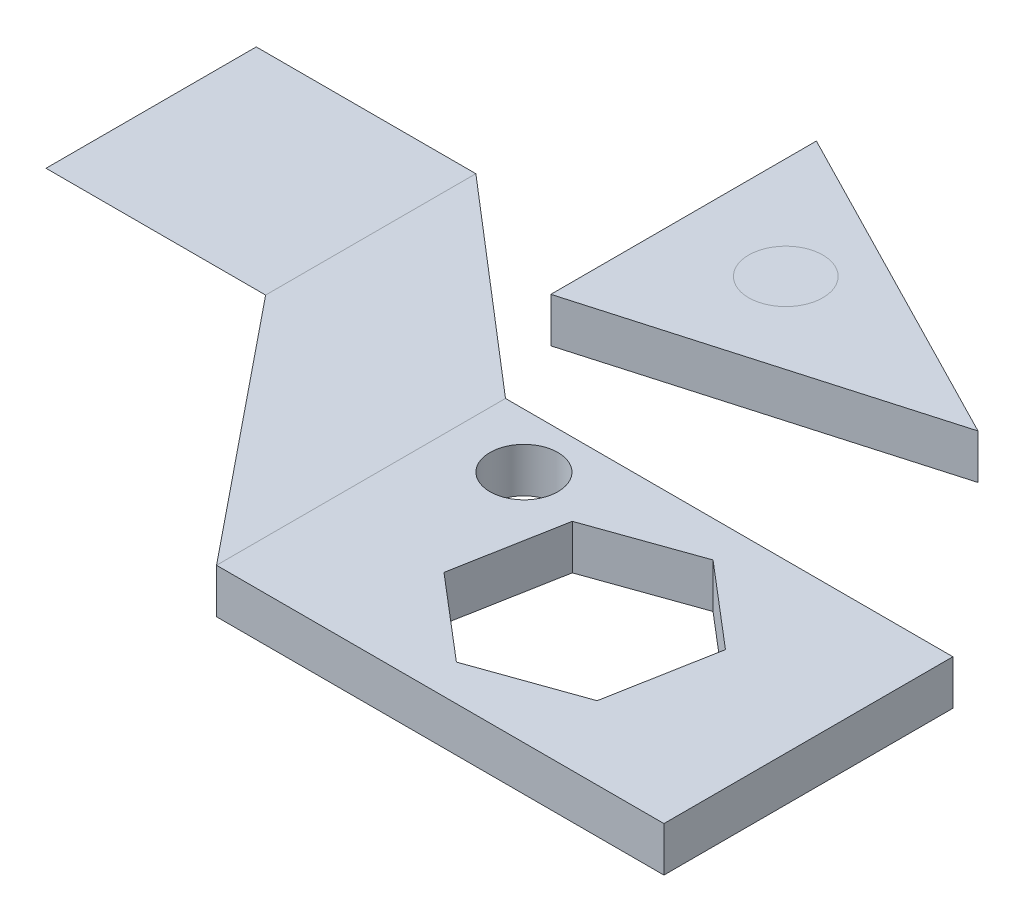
ISO-10303-21;
HEADER;
FILE_DESCRIPTION(('STEP AP214'),'2;1');
FILE_NAME('part.step','',(''),(''),'','','');
FILE_SCHEMA(('AUTOMOTIVE_DESIGN { 1 0 10303 214 1 1 1 1 }'));
ENDSEC;
DATA;
#1=APPLICATION_CONTEXT('core data for automotive mechanical design processes');
#2=APPLICATION_PROTOCOL_DEFINITION('international standard','automotive_design',2000,#1);
#3=PRODUCT_CONTEXT('',#1,'mechanical');
#4=PRODUCT('Part','Part','',(#3));
#5=PRODUCT_RELATED_PRODUCT_CATEGORY('part','',(#4));
#6=PRODUCT_DEFINITION_FORMATION('','',#4);
#7=PRODUCT_DEFINITION_CONTEXT('part definition',#1,'design');
#8=PRODUCT_DEFINITION('design','',#6,#7);
#9=PRODUCT_DEFINITION_SHAPE('','',#8);
#10=(LENGTH_UNIT() NAMED_UNIT(*) SI_UNIT(.MILLI.,.METRE.));
#11=(NAMED_UNIT(*) PLANE_ANGLE_UNIT() SI_UNIT($,.RADIAN.));
#12=(NAMED_UNIT(*) SI_UNIT($,.STERADIAN.) SOLID_ANGLE_UNIT());
#13=UNCERTAINTY_MEASURE_WITH_UNIT(LENGTH_MEASURE(1.E-05),#10,'distance_accuracy_value','');
#14=(GEOMETRIC_REPRESENTATION_CONTEXT(3) GLOBAL_UNCERTAINTY_ASSIGNED_CONTEXT((#13)) GLOBAL_UNIT_ASSIGNED_CONTEXT((#10,
#11,#12)) REPRESENTATION_CONTEXT('',''));
#15=CARTESIAN_POINT('',(0.,0.,0.));
#16=DIRECTION('',(0.,0.,1.));
#17=DIRECTION('',(1.,0.,0.));
#18=AXIS2_PLACEMENT_3D('',#15,#16,#17);
#19=CARTESIAN_POINT('',(-80.7820942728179,0.,81.5293352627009));
#20=DIRECTION('',(0.,-1.,0.));
#21=DIRECTION('',(0.,0.,-1.));
#22=AXIS2_PLACEMENT_3D('',#19,#20,#21);
#23=PLANE('',#22);
#24=DIRECTION('',(0.,0.,-1.));
#25=VECTOR('',#24,1.);
#26=CARTESIAN_POINT('',(-80.7820942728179,0.,21.7119363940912));
#27=LINE('',#26,#25);
#28=CARTESIAN_POINT('',(-80.7820942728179,0.,81.5293352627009));
#29=VERTEX_POINT('',#28);
#30=CARTESIAN_POINT('',(-80.7820942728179,0.,-38.1054624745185));
#31=VERTEX_POINT('',#30);
#32=EDGE_CURVE('E13',#29,#31,#27,.T.);
#33=ORIENTED_EDGE('',*,*,#32,.T.);
#34=DIRECTION('',(0.758711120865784,0.,0.651427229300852));
#35=VECTOR('',#34,1.);
#36=CARTESIAN_POINT('',(-21.1909433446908,0.,13.0593317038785));
#37=LINE('',#36,#35);
#38=CARTESIAN_POINT('',(38.4002075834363,0.,64.2241258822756));
#39=VERTEX_POINT('',#38);
#40=EDGE_CURVE('E71',#31,#39,#37,.T.);
#41=ORIENTED_EDGE('',*,*,#40,.T.);
#42=DIRECTION('',(0.,0.,1.));
#43=VECTOR('',#42,1.);
#44=CARTESIAN_POINT('',(38.4002075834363,0.,146.432685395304));
#45=LINE('',#44,#43);
#46=CARTESIAN_POINT('',(38.4002075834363,0.,228.641244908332));
#47=VERTEX_POINT('',#46);
#48=EDGE_CURVE('E79',#39,#47,#45,.T.);
#49=ORIENTED_EDGE('',*,*,#48,.T.);
#50=DIRECTION('',(-0.629490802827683,0.,-0.777007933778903));
#51=VECTOR('',#50,1.);
#52=CARTESIAN_POINT('',(-21.1909433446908,0.,155.085290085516));
#53=LINE('',#52,#51);
#54=EDGE_CURVE('E65',#47,#29,#53,.T.);
#55=ORIENTED_EDGE('',*,*,#54,.T.);
#56=EDGE_LOOP('',(#33,#41,#49,#55));
#57=FACE_BOUND('',#56,.T.);
#58=ADVANCED_FACE('F64',(#57),#23,.T.);
#59=OPEN_SHELL('',(#58));
#60=SHELL_BASED_SURFACE_MODEL('B2',(#59));
#61=CARTESIAN_POINT('',(0.,0.,0.));
#62=DIRECTION('',(0.,1.,0.));
#63=DIRECTION('',(0.,0.,1.));
#64=AXIS2_PLACEMENT_3D('',#61,#62,#63);
#65=PLANE('',#64);
#66=CARTESIAN_POINT('',(79.9464688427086,0.,95.2665323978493));
#67=DIRECTION('',(0.,1.,0.));
#68=DIRECTION('',(0.,0.,1.));
#69=AXIS2_PLACEMENT_3D('',#66,#67,#68);
#70=CIRCLE('',#69,19.3434847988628);
#71=CARTESIAN_POINT('',(79.9464688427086,0.,114.610017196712));
#72=VERTEX_POINT('',#71);
#73=EDGE_CURVE('E162',#72,#72,#70,.T.);
#74=ORIENTED_EDGE('',*,*,#73,.F.);
#75=EDGE_LOOP('',(#74));
#76=FACE_BOUND('',#75,.T.);
#77=DIRECTION('',(0.761243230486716,0.,0.648466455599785));
#78=VECTOR('',#77,1.);
#79=CARTESIAN_POINT('',(106.609295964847,0.,167.440394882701));
#80=LINE('',#79,#78);
#81=CARTESIAN_POINT('',(106.609295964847,0.,167.440394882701));
#82=VERTEX_POINT('',#81);
#83=CARTESIAN_POINT('',(154.343298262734,0.,208.102693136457));
#84=VERTEX_POINT('',#83);
#85=EDGE_CURVE('E155',#82,#84,#80,.T.);
#86=ORIENTED_EDGE('',*,*,#85,.F.);
#87=DIRECTION('',(-0.180966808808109,0.,0.983489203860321));
#88=VECTOR('',#87,1.);
#89=CARTESIAN_POINT('',(117.956878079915,0.,105.770387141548));
#90=LINE('',#89,#88);
#91=CARTESIAN_POINT('',(117.956878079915,0.,105.770387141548));
#92=VERTEX_POINT('',#91);
#93=EDGE_CURVE('E157',#92,#82,#90,.T.);
#94=ORIENTED_EDGE('',*,*,#93,.F.);
#95=DIRECTION('',(-0.942210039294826,0.,0.335022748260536));
#96=VECTOR('',#95,1.);
#97=CARTESIAN_POINT('',(177.03846249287,0.,84.7626776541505));
#98=LINE('',#97,#96);
#99=CARTESIAN_POINT('',(177.03846249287,0.,84.7626776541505));
#100=VERTEX_POINT('',#99);
#101=EDGE_CURVE('E165',#100,#92,#98,.T.);
#102=ORIENTED_EDGE('',*,*,#101,.F.);
#103=DIRECTION('',(-0.761243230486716,0.,-0.648466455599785));
#104=VECTOR('',#103,1.);
#105=CARTESIAN_POINT('',(224.772464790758,0.,125.424975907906));
#106=LINE('',#105,#104);
#107=CARTESIAN_POINT('',(224.772464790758,0.,125.424975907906));
#108=VERTEX_POINT('',#107);
#109=EDGE_CURVE('E170',#108,#100,#106,.T.);
#110=ORIENTED_EDGE('',*,*,#109,.F.);
#111=DIRECTION('',(0.180966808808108,0.,-0.983489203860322));
#112=VECTOR('',#111,1.);
#113=CARTESIAN_POINT('',(213.42488267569,0.,187.094983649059));
#114=LINE('',#113,#112);
#115=CARTESIAN_POINT('',(213.42488267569,0.,187.094983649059));
#116=VERTEX_POINT('',#115);
#117=EDGE_CURVE('E177',#116,#108,#114,.T.);
#118=ORIENTED_EDGE('',*,*,#117,.F.);
#119=DIRECTION('',(0.942210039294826,0.,-0.335022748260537));
#120=VECTOR('',#119,1.);
#121=CARTESIAN_POINT('',(154.343298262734,0.,208.102693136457));
#122=LINE('',#121,#120);
#123=EDGE_CURVE('E160',#84,#116,#122,.T.);
#124=ORIENTED_EDGE('',*,*,#123,.F.);
#125=EDGE_LOOP('',(#86,#94,#102,#110,#118,#124));
#126=FACE_BOUND('',#125,.T.);
#127=DIRECTION('',(0.,0.,1.));
#128=VECTOR('',#127,1.);
#129=CARTESIAN_POINT('',(38.4002075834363,0.,64.2241258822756));
#130=LINE('',#129,#128);
#131=CARTESIAN_POINT('',(38.4002075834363,0.,64.2241258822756));
#132=VERTEX_POINT('',#131);
#133=CARTESIAN_POINT('',(38.4002075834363,0.,228.641244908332));
#134=VERTEX_POINT('',#133);
#135=EDGE_CURVE('E125',#132,#134,#130,.T.);
#136=ORIENTED_EDGE('',*,*,#135,.T.);
#137=DIRECTION('',(1.,0.,0.));
#138=VECTOR('',#137,1.);
#139=CARTESIAN_POINT('',(38.4002075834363,0.,228.641244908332));
#140=LINE('',#139,#138);
#141=CARTESIAN_POINT('',(292.981553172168,0.,228.641244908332));
#142=VERTEX_POINT('',#141);
#143=EDGE_CURVE('E185',#134,#142,#140,.T.);
#144=ORIENTED_EDGE('',*,*,#143,.T.);
#145=DIRECTION('',(0.,0.,-1.));
#146=VECTOR('',#145,1.);
#147=CARTESIAN_POINT('',(292.981553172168,0.,64.2241258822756));
#148=LINE('',#147,#146);
#149=CARTESIAN_POINT('',(292.981553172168,0.,64.2241258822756));
#150=VERTEX_POINT('',#149);
#151=EDGE_CURVE('E121',#142,#150,#148,.T.);
#152=ORIENTED_EDGE('',*,*,#151,.T.);
#153=DIRECTION('',(-1.,0.,0.));
#154=VECTOR('',#153,1.);
#155=CARTESIAN_POINT('',(38.4002075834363,0.,64.2241258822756));
#156=LINE('',#155,#154);
#157=EDGE_CURVE('E62',#150,#132,#156,.T.);
#158=ORIENTED_EDGE('',*,*,#157,.T.);
#159=EDGE_LOOP('',(#136,#144,#152,#158));
#160=FACE_BOUND('',#159,.T.);
#161=ADVANCED_FACE('F116',(#76,#126,#160),#65,.T.);
#162=OPEN_SHELL('',(#161));
#163=SHELL_BASED_SURFACE_MODEL('B7',(#162));
#164=CARTESIAN_POINT('',(58.0016480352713,0.,-75.6757600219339));
#165=DIRECTION('',(0.,1.,0.));
#166=DIRECTION('',(0.,0.,1.));
#167=AXIS2_PLACEMENT_3D('',#164,#165,#166);
#168=PLANE('',#167);
#169=CARTESIAN_POINT('',(58.0016480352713,0.,-75.6757600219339));
#170=DIRECTION('',(0.,1.,0.));
#171=DIRECTION('',(0.,0.,1.));
#172=AXIS2_PLACEMENT_3D('',#169,#170,#171);
#173=CIRCLE('',#172,21.0766431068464);
#174=CARTESIAN_POINT('',(58.0016480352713,0.,-54.5991169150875));
#175=VERTEX_POINT('',#174);
#176=EDGE_CURVE('E115',#175,#175,#173,.T.);
#177=ORIENTED_EDGE('',*,*,#176,.T.);
#178=EDGE_LOOP('',(#177));
#179=FACE_BOUND('',#178,.T.);
#180=ADVANCED_FACE('F233',(#179),#168,.T.);
#181=OPEN_SHELL('',(#180));
#182=SHELL_BASED_SURFACE_MODEL('B56',(#181));
#183=CARTESIAN_POINT('',(0.,0.,0.));
#184=DIRECTION('',(0.,1.,0.));
#185=DIRECTION('',(0.,0.,1.));
#186=AXIS2_PLACEMENT_3D('',#183,#184,#185);
#187=PLANE('',#186);
#188=DIRECTION('',(0.,0.,1.));
#189=VECTOR('',#188,1.);
#190=CARTESIAN_POINT('',(-205.750421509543,0.,-38.1054624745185));
#191=LINE('',#190,#189);
#192=CARTESIAN_POINT('',(-205.750421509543,0.,-38.1054624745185));
#193=VERTEX_POINT('',#192);
#194=CARTESIAN_POINT('',(-205.750421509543,0.,81.5293352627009));
#195=VERTEX_POINT('',#194);
#196=EDGE_CURVE('E269',#193,#195,#191,.T.);
#197=ORIENTED_EDGE('',*,*,#196,.T.);
#198=DIRECTION('',(1.,0.,0.));
#199=VECTOR('',#198,1.);
#200=CARTESIAN_POINT('',(-205.750421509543,0.,81.5293352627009));
#201=LINE('',#200,#199);
#202=CARTESIAN_POINT('',(-80.7820942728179,0.,81.5293352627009));
#203=VERTEX_POINT('',#202);
#204=EDGE_CURVE('E280',#195,#203,#201,.T.);
#205=ORIENTED_EDGE('',*,*,#204,.T.);
#206=DIRECTION('',(0.,0.,-1.));
#207=VECTOR('',#206,1.);
#208=CARTESIAN_POINT('',(-80.7820942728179,0.,-38.1054624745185));
#209=LINE('',#208,#207);
#210=CARTESIAN_POINT('',(-80.7820942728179,0.,-38.1054624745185));
#211=VERTEX_POINT('',#210);
#212=EDGE_CURVE('E265',#203,#211,#209,.T.);
#213=ORIENTED_EDGE('',*,*,#212,.T.);
#214=DIRECTION('',(-1.,0.,0.));
#215=VECTOR('',#214,1.);
#216=CARTESIAN_POINT('',(-205.750421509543,0.,-38.1054624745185));
#217=LINE('',#216,#215);
#218=EDGE_CURVE('E231',#211,#193,#217,.T.);
#219=ORIENTED_EDGE('',*,*,#218,.T.);
#220=EDGE_LOOP('',(#197,#205,#213,#219));
#221=FACE_BOUND('',#220,.T.);
#222=ADVANCED_FACE('F260',(#221),#187,.T.);
#223=OPEN_SHELL('',(#222));
#224=SHELL_BASED_SURFACE_MODEL('B110',(#223));
#225=CARTESIAN_POINT('',(38.4002075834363,-25.4,64.2241258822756));
#226=DIRECTION('',(-1.,0.,0.));
#227=DIRECTION('',(0.,0.,1.));
#228=AXIS2_PLACEMENT_3D('',#225,#226,#227);
#229=PLANE('',#228);
#230=DIRECTION('',(0.,0.,1.));
#231=VECTOR('',#230,1.);
#232=CARTESIAN_POINT('',(38.4002075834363,0.,64.2241258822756));
#233=LINE('',#232,#231);
#234=CARTESIAN_POINT('',(38.4002075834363,0.,64.2241258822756));
#235=VERTEX_POINT('',#234);
#236=CARTESIAN_POINT('',(38.4002075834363,0.,228.641244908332));
#237=VERTEX_POINT('',#236);
#238=EDGE_CURVE('E440',#235,#237,#233,.T.);
#239=ORIENTED_EDGE('',*,*,#238,.F.);
#240=DIRECTION('',(0.,1.,0.));
#241=VECTOR('',#240,1.);
#242=CARTESIAN_POINT('',(38.4002075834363,-25.4,64.2241258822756));
#243=LINE('',#242,#241);
#244=CARTESIAN_POINT('',(38.4002075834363,-25.4,64.2241258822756));
#245=VERTEX_POINT('',#244);
#246=EDGE_CURVE('E258',#245,#235,#243,.T.);
#247=ORIENTED_EDGE('',*,*,#246,.F.);
#248=DIRECTION('',(0.,0.,1.));
#249=VECTOR('',#248,1.);
#250=CARTESIAN_POINT('',(38.4002075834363,-25.4,64.2241258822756));
#251=LINE('',#250,#249);
#252=CARTESIAN_POINT('',(38.4002075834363,-25.4,228.641244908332));
#253=VERTEX_POINT('',#252);
#254=EDGE_CURVE('E451',#245,#253,#251,.T.);
#255=ORIENTED_EDGE('',*,*,#254,.T.);
#256=DIRECTION('',(0.,1.,0.));
#257=VECTOR('',#256,1.);
#258=CARTESIAN_POINT('',(38.4002075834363,-25.4,228.641244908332));
#259=LINE('',#258,#257);
#260=EDGE_CURVE('E314',#253,#237,#259,.T.);
#261=ORIENTED_EDGE('',*,*,#260,.T.);
#262=EDGE_LOOP('',(#239,#247,#255,#261));
#263=FACE_BOUND('',#262,.T.);
#264=ADVANCED_FACE('F312',(#263),#229,.T.);
#265=CARTESIAN_POINT('',(38.4002075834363,-25.4,64.2241258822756));
#266=DIRECTION('',(0.,0.,-1.));
#267=DIRECTION('',(-1.,0.,0.));
#268=AXIS2_PLACEMENT_3D('',#265,#266,#267);
#269=PLANE('',#268);
#270=DIRECTION('',(-1.,0.,0.));
#271=VECTOR('',#270,1.);
#272=CARTESIAN_POINT('',(38.4002075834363,0.,64.2241258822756));
#273=LINE('',#272,#271);
#274=CARTESIAN_POINT('',(292.981553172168,0.,64.2241258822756));
#275=VERTEX_POINT('',#274);
#276=EDGE_CURVE('E455',#275,#235,#273,.T.);
#277=ORIENTED_EDGE('',*,*,#276,.F.);
#278=DIRECTION('',(0.,1.,0.));
#279=VECTOR('',#278,1.);
#280=CARTESIAN_POINT('',(292.981553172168,-25.4,64.2241258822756));
#281=LINE('',#280,#279);
#282=CARTESIAN_POINT('',(292.981553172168,-25.4,64.2241258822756));
#283=VERTEX_POINT('',#282);
#284=EDGE_CURVE('E318',#283,#275,#281,.T.);
#285=ORIENTED_EDGE('',*,*,#284,.F.);
#286=DIRECTION('',(-1.,0.,0.));
#287=VECTOR('',#286,1.);
#288=CARTESIAN_POINT('',(38.4002075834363,-25.4,64.2241258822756));
#289=LINE('',#288,#287);
#290=EDGE_CURVE('E461',#283,#245,#289,.T.);
#291=ORIENTED_EDGE('',*,*,#290,.T.);
#292=ORIENTED_EDGE('',*,*,#246,.T.);
#293=EDGE_LOOP('',(#277,#285,#291,#292));
#294=FACE_BOUND('',#293,.T.);
#295=ADVANCED_FACE('F492',(#294),#269,.T.);
#296=CARTESIAN_POINT('',(292.981553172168,-25.4,64.2241258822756));
#297=DIRECTION('',(1.,0.,0.));
#298=DIRECTION('',(0.,0.,-1.));
#299=AXIS2_PLACEMENT_3D('',#296,#297,#298);
#300=PLANE('',#299);
#301=DIRECTION('',(0.,0.,-1.));
#302=VECTOR('',#301,1.);
#303=CARTESIAN_POINT('',(292.981553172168,0.,64.2241258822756));
#304=LINE('',#303,#302);
#305=CARTESIAN_POINT('',(292.981553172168,0.,228.641244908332));
#306=VERTEX_POINT('',#305);
#307=EDGE_CURVE('E471',#306,#275,#304,.T.);
#308=ORIENTED_EDGE('',*,*,#307,.F.);
#309=DIRECTION('',(0.,1.,0.));
#310=VECTOR('',#309,1.);
#311=CARTESIAN_POINT('',(292.981553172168,-25.4,228.641244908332));
#312=LINE('',#311,#310);
#313=CARTESIAN_POINT('',(292.981553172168,-25.4,228.641244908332));
#314=VERTEX_POINT('',#313);
#315=EDGE_CURVE('E478',#314,#306,#312,.T.);
#316=ORIENTED_EDGE('',*,*,#315,.F.);
#317=DIRECTION('',(0.,0.,-1.));
#318=VECTOR('',#317,1.);
#319=CARTESIAN_POINT('',(292.981553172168,-25.4,64.2241258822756));
#320=LINE('',#319,#318);
#321=EDGE_CURVE('E458',#314,#283,#320,.T.);
#322=ORIENTED_EDGE('',*,*,#321,.T.);
#323=ORIENTED_EDGE('',*,*,#284,.T.);
#324=EDGE_LOOP('',(#308,#316,#322,#323));
#325=FACE_BOUND('',#324,.T.);
#326=ADVANCED_FACE('F490',(#325),#300,.T.);
#327=CARTESIAN_POINT('',(38.4002075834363,-25.4,228.641244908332));
#328=DIRECTION('',(0.,0.,1.));
#329=DIRECTION('',(1.,0.,0.));
#330=AXIS2_PLACEMENT_3D('',#327,#328,#329);
#331=PLANE('',#330);
#332=DIRECTION('',(1.,0.,0.));
#333=VECTOR('',#332,1.);
#334=CARTESIAN_POINT('',(38.4002075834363,0.,228.641244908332));
#335=LINE('',#334,#333);
#336=EDGE_CURVE('E467',#237,#306,#335,.T.);
#337=ORIENTED_EDGE('',*,*,#336,.F.);
#338=ORIENTED_EDGE('',*,*,#260,.F.);
#339=DIRECTION('',(1.,0.,0.));
#340=VECTOR('',#339,1.);
#341=CARTESIAN_POINT('',(38.4002075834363,-25.4,228.641244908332));
#342=LINE('',#341,#340);
#343=EDGE_CURVE('E454',#253,#314,#342,.T.);
#344=ORIENTED_EDGE('',*,*,#343,.T.);
#345=ORIENTED_EDGE('',*,*,#315,.T.);
#346=EDGE_LOOP('',(#337,#338,#344,#345));
#347=FACE_BOUND('',#346,.T.);
#348=ADVANCED_FACE('F486',(#347),#331,.T.);
#349=CARTESIAN_POINT('',(0.,-25.4,0.));
#350=DIRECTION('',(0.,1.,0.));
#351=DIRECTION('',(0.,0.,1.));
#352=AXIS2_PLACEMENT_3D('',#349,#350,#351);
#353=PLANE('',#352);
#354=CARTESIAN_POINT('',(79.9464688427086,-25.4,95.2665323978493));
#355=DIRECTION('',(0.,1.,0.));
#356=DIRECTION('',(0.,0.,1.));
#357=AXIS2_PLACEMENT_3D('',#354,#355,#356);
#358=CIRCLE('',#357,19.3434847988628);
#359=CARTESIAN_POINT('',(79.9464688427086,-25.4,114.610017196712));
#360=VERTEX_POINT('',#359);
#361=EDGE_CURVE('E427',#360,#360,#358,.T.);
#362=ORIENTED_EDGE('',*,*,#361,.T.);
#363=EDGE_LOOP('',(#362));
#364=FACE_BOUND('',#363,.T.);
#365=DIRECTION('',(0.761243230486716,0.,0.648466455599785));
#366=VECTOR('',#365,1.);
#367=CARTESIAN_POINT('',(106.609295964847,-25.4,167.440394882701));
#368=LINE('',#367,#366);
#369=CARTESIAN_POINT('',(106.609295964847,-25.4,167.440394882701));
#370=VERTEX_POINT('',#369);
#371=CARTESIAN_POINT('',(154.343298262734,-25.4,208.102693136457));
#372=VERTEX_POINT('',#371);
#373=EDGE_CURVE('E398',#370,#372,#368,.T.);
#374=ORIENTED_EDGE('',*,*,#373,.T.);
#375=DIRECTION('',(0.942210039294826,0.,-0.335022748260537));
#376=VECTOR('',#375,1.);
#377=CARTESIAN_POINT('',(154.343298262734,-25.4,208.102693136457));
#378=LINE('',#377,#376);
#379=CARTESIAN_POINT('',(213.42488267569,-25.4,187.094983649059));
#380=VERTEX_POINT('',#379);
#381=EDGE_CURVE('E392',#372,#380,#378,.T.);
#382=ORIENTED_EDGE('',*,*,#381,.T.);
#383=DIRECTION('',(0.180966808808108,0.,-0.983489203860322));
#384=VECTOR('',#383,1.);
#385=CARTESIAN_POINT('',(213.42488267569,-25.4,187.094983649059));
#386=LINE('',#385,#384);
#387=CARTESIAN_POINT('',(224.772464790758,-25.4,125.424975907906));
#388=VERTEX_POINT('',#387);
#389=EDGE_CURVE('E401',#380,#388,#386,.T.);
#390=ORIENTED_EDGE('',*,*,#389,.T.);
#391=DIRECTION('',(-0.761243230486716,0.,-0.648466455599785));
#392=VECTOR('',#391,1.);
#393=CARTESIAN_POINT('',(224.772464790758,-25.4,125.424975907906));
#394=LINE('',#393,#392);
#395=CARTESIAN_POINT('',(177.03846249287,-25.4,84.7626776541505));
#396=VERTEX_POINT('',#395);
#397=EDGE_CURVE('E326',#388,#396,#394,.T.);
#398=ORIENTED_EDGE('',*,*,#397,.T.);
#399=DIRECTION('',(-0.942210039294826,0.,0.335022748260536));
#400=VECTOR('',#399,1.);
#401=CARTESIAN_POINT('',(177.03846249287,-25.4,84.7626776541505));
#402=LINE('',#401,#400);
#403=CARTESIAN_POINT('',(117.956878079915,-25.4,105.770387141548));
#404=VERTEX_POINT('',#403);
#405=EDGE_CURVE('E419',#396,#404,#402,.T.);
#406=ORIENTED_EDGE('',*,*,#405,.T.);
#407=DIRECTION('',(-0.180966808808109,0.,0.983489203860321));
#408=VECTOR('',#407,1.);
#409=CARTESIAN_POINT('',(117.956878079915,-25.4,105.770387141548));
#410=LINE('',#409,#408);
#411=EDGE_CURVE('E422',#404,#370,#410,.T.);
#412=ORIENTED_EDGE('',*,*,#411,.T.);
#413=EDGE_LOOP('',(#374,#382,#390,#398,#406,#412));
#414=FACE_BOUND('',#413,.T.);
#415=ORIENTED_EDGE('',*,*,#254,.F.);
#416=ORIENTED_EDGE('',*,*,#290,.F.);
#417=ORIENTED_EDGE('',*,*,#321,.F.);
#418=ORIENTED_EDGE('',*,*,#343,.F.);
#419=EDGE_LOOP('',(#415,#416,#417,#418));
#420=FACE_BOUND('',#419,.T.);
#421=ADVANCED_FACE('F405',(#364,#414,#420),#353,.F.);
#422=CARTESIAN_POINT('',(154.343298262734,-25.4,208.102693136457));
#423=DIRECTION('',(0.335022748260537,0.,0.942210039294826));
#424=DIRECTION('',(0.942210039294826,0.,-0.335022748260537));
#425=AXIS2_PLACEMENT_3D('',#422,#423,#424);
#426=PLANE('',#425);
#427=DIRECTION('',(0.942210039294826,0.,-0.335022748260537));
#428=VECTOR('',#427,1.);
#429=CARTESIAN_POINT('',(154.343298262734,0.,208.102693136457));
#430=LINE('',#429,#428);
#431=CARTESIAN_POINT('',(154.343298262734,0.,208.102693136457));
#432=VERTEX_POINT('',#431);
#433=CARTESIAN_POINT('',(213.42488267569,0.,187.094983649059));
#434=VERTEX_POINT('',#433);
#435=EDGE_CURVE('E395',#432,#434,#430,.T.);
#436=ORIENTED_EDGE('',*,*,#435,.T.);
#437=DIRECTION('',(0.,1.,0.));
#438=VECTOR('',#437,1.);
#439=CARTESIAN_POINT('',(213.42488267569,-25.4,187.094983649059));
#440=LINE('',#439,#438);
#441=EDGE_CURVE('E387',#380,#434,#440,.T.);
#442=ORIENTED_EDGE('',*,*,#441,.F.);
#443=ORIENTED_EDGE('',*,*,#381,.F.);
#444=DIRECTION('',(0.,1.,0.));
#445=VECTOR('',#444,1.);
#446=CARTESIAN_POINT('',(154.343298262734,-25.4,208.102693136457));
#447=LINE('',#446,#445);
#448=EDGE_CURVE('E438',#372,#432,#447,.T.);
#449=ORIENTED_EDGE('',*,*,#448,.T.);
#450=EDGE_LOOP('',(#436,#442,#443,#449));
#451=FACE_BOUND('',#450,.T.);
#452=ADVANCED_FACE('F389',(#451),#426,.F.);
#453=CARTESIAN_POINT('',(106.609295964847,-25.4,167.440394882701));
#454=DIRECTION('',(-0.648466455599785,0.,0.761243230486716));
#455=DIRECTION('',(0.761243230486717,0.,0.648466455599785));
#456=AXIS2_PLACEMENT_3D('',#453,#454,#455);
#457=PLANE('',#456);
#458=DIRECTION('',(0.761243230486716,0.,0.648466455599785));
#459=VECTOR('',#458,1.);
#460=CARTESIAN_POINT('',(106.609295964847,0.,167.440394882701));
#461=LINE('',#460,#459);
#462=CARTESIAN_POINT('',(106.609295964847,0.,167.440394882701));
#463=VERTEX_POINT('',#462);
#464=EDGE_CURVE('E409',#463,#432,#461,.T.);
#465=ORIENTED_EDGE('',*,*,#464,.T.);
#466=ORIENTED_EDGE('',*,*,#448,.F.);
#467=ORIENTED_EDGE('',*,*,#373,.F.);
#468=DIRECTION('',(0.,1.,0.));
#469=VECTOR('',#468,1.);
#470=CARTESIAN_POINT('',(106.609295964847,-25.4,167.440394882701));
#471=LINE('',#470,#469);
#472=EDGE_CURVE('E441',#370,#463,#471,.T.);
#473=ORIENTED_EDGE('',*,*,#472,.T.);
#474=EDGE_LOOP('',(#465,#466,#467,#473));
#475=FACE_BOUND('',#474,.T.);
#476=ADVANCED_FACE('F510',(#475),#457,.F.);
#477=CARTESIAN_POINT('',(117.956878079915,-25.4,105.770387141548));
#478=DIRECTION('',(-0.983489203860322,0.,-0.180966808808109));
#479=DIRECTION('',(-0.180966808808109,0.,0.983489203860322));
#480=AXIS2_PLACEMENT_3D('',#477,#478,#479);
#481=PLANE('',#480);
#482=DIRECTION('',(-0.180966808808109,0.,0.983489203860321));
#483=VECTOR('',#482,1.);
#484=CARTESIAN_POINT('',(117.956878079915,0.,105.770387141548));
#485=LINE('',#484,#483);
#486=CARTESIAN_POINT('',(117.956878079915,0.,105.770387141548));
#487=VERTEX_POINT('',#486);
#488=EDGE_CURVE('E412',#487,#463,#485,.T.);
#489=ORIENTED_EDGE('',*,*,#488,.T.);
#490=ORIENTED_EDGE('',*,*,#472,.F.);
#491=ORIENTED_EDGE('',*,*,#411,.F.);
#492=DIRECTION('',(0.,1.,0.));
#493=VECTOR('',#492,1.);
#494=CARTESIAN_POINT('',(117.956878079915,-25.4,105.770387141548));
#495=LINE('',#494,#493);
#496=EDGE_CURVE('E444',#404,#487,#495,.T.);
#497=ORIENTED_EDGE('',*,*,#496,.T.);
#498=EDGE_LOOP('',(#489,#490,#491,#497));
#499=FACE_BOUND('',#498,.T.);
#500=ADVANCED_FACE('F531',(#499),#481,.F.);
#501=CARTESIAN_POINT('',(177.03846249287,-25.4,84.7626776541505));
#502=DIRECTION('',(-0.335022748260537,0.,-0.942210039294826));
#503=DIRECTION('',(-0.942210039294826,0.,0.335022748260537));
#504=AXIS2_PLACEMENT_3D('',#501,#502,#503);
#505=PLANE('',#504);
#506=DIRECTION('',(-0.942210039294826,0.,0.335022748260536));
#507=VECTOR('',#506,1.);
#508=CARTESIAN_POINT('',(177.03846249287,0.,84.7626776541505));
#509=LINE('',#508,#507);
#510=CARTESIAN_POINT('',(177.03846249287,0.,84.7626776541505));
#511=VERTEX_POINT('',#510);
#512=EDGE_CURVE('E433',#511,#487,#509,.T.);
#513=ORIENTED_EDGE('',*,*,#512,.T.);
#514=ORIENTED_EDGE('',*,*,#496,.F.);
#515=ORIENTED_EDGE('',*,*,#405,.F.);
#516=DIRECTION('',(0.,1.,0.));
#517=VECTOR('',#516,1.);
#518=CARTESIAN_POINT('',(177.03846249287,-25.4,84.7626776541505));
#519=LINE('',#518,#517);
#520=EDGE_CURVE('E447',#396,#511,#519,.T.);
#521=ORIENTED_EDGE('',*,*,#520,.T.);
#522=EDGE_LOOP('',(#513,#514,#515,#521));
#523=FACE_BOUND('',#522,.T.);
#524=ADVANCED_FACE('F535',(#523),#505,.F.);
#525=CARTESIAN_POINT('',(224.772464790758,-25.4,125.424975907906));
#526=DIRECTION('',(0.648466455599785,0.,-0.761243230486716));
#527=DIRECTION('',(-0.761243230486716,0.,-0.648466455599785));
#528=AXIS2_PLACEMENT_3D('',#525,#526,#527);
#529=PLANE('',#528);
#530=DIRECTION('',(-0.761243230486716,0.,-0.648466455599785));
#531=VECTOR('',#530,1.);
#532=CARTESIAN_POINT('',(224.772464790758,0.,125.424975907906));
#533=LINE('',#532,#531);
#534=CARTESIAN_POINT('',(224.772464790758,0.,125.424975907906));
#535=VERTEX_POINT('',#534);
#536=EDGE_CURVE('E430',#535,#511,#533,.T.);
#537=ORIENTED_EDGE('',*,*,#536,.T.);
#538=ORIENTED_EDGE('',*,*,#520,.F.);
#539=ORIENTED_EDGE('',*,*,#397,.F.);
#540=DIRECTION('',(0.,1.,0.));
#541=VECTOR('',#540,1.);
#542=CARTESIAN_POINT('',(224.772464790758,-25.4,125.424975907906));
#543=LINE('',#542,#541);
#544=EDGE_CURVE('E397',#388,#535,#543,.T.);
#545=ORIENTED_EDGE('',*,*,#544,.T.);
#546=EDGE_LOOP('',(#537,#538,#539,#545));
#547=FACE_BOUND('',#546,.T.);
#548=ADVANCED_FACE('F526',(#547),#529,.F.);
#549=CARTESIAN_POINT('',(213.42488267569,-25.4,187.094983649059));
#550=DIRECTION('',(0.983489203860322,0.,0.180966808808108));
#551=DIRECTION('',(0.180966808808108,0.,-0.983489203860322));
#552=AXIS2_PLACEMENT_3D('',#549,#550,#551);
#553=PLANE('',#552);
#554=DIRECTION('',(0.180966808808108,0.,-0.983489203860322));
#555=VECTOR('',#554,1.);
#556=CARTESIAN_POINT('',(213.42488267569,0.,187.094983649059));
#557=LINE('',#556,#555);
#558=EDGE_CURVE('E331',#434,#535,#557,.T.);
#559=ORIENTED_EDGE('',*,*,#558,.T.);
#560=ORIENTED_EDGE('',*,*,#544,.F.);
#561=ORIENTED_EDGE('',*,*,#389,.F.);
#562=ORIENTED_EDGE('',*,*,#441,.T.);
#563=EDGE_LOOP('',(#559,#560,#561,#562));
#564=FACE_BOUND('',#563,.T.);
#565=ADVANCED_FACE('F402',(#564),#553,.F.);
#566=CARTESIAN_POINT('',(79.9464688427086,-25.4,95.2665323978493));
#567=DIRECTION('',(0.,1.,0.));
#568=DIRECTION('',(0.,0.,1.));
#569=AXIS2_PLACEMENT_3D('',#566,#567,#568);
#570=CYLINDRICAL_SURFACE('',#569,19.3434847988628);
#571=ORIENTED_EDGE('',*,*,#361,.F.);
#572=EDGE_LOOP('',(#571));
#573=FACE_BOUND('',#572,.T.);
#574=CARTESIAN_POINT('',(79.9464688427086,0.,95.2665323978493));
#575=DIRECTION('',(0.,1.,0.));
#576=DIRECTION('',(0.,0.,1.));
#577=AXIS2_PLACEMENT_3D('',#574,#575,#576);
#578=CIRCLE('',#577,19.3434847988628);
#579=CARTESIAN_POINT('',(79.9464688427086,0.,114.610017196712));
#580=VERTEX_POINT('',#579);
#581=EDGE_CURVE('E415',#580,#580,#578,.T.);
#582=ORIENTED_EDGE('',*,*,#581,.T.);
#583=EDGE_LOOP('',(#582));
#584=FACE_BOUND('',#583,.T.);
#585=ADVANCED_FACE('F520',(#573,#584),#570,.F.);
#586=OPEN_SHELL('',(#264,#295,#326,#348,#421,#452,#476,#500,#524,#548,#565,#585));
#587=SHELL_BASED_SURFACE_MODEL('B225',(#586));
#588=CARTESIAN_POINT('',(188.850758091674,-25.4,-54.2005244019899));
#589=DIRECTION('',(0.275865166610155,0.,0.961196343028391));
#590=DIRECTION('',(0.961196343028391,0.,-0.275865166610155));
#591=AXIS2_PLACEMENT_3D('',#588,#589,#590);
#592=PLANE('',#591);
#593=DIRECTION('',(0.961196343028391,0.,-0.275865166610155));
#594=VECTOR('',#593,1.);
#595=CARTESIAN_POINT('',(188.850758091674,0.,-54.2005244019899));
#596=LINE('',#595,#594);
#597=CARTESIAN_POINT('',(0.,0.,0.));
#598=VERTEX_POINT('',#597);
#599=CARTESIAN_POINT('',(188.850758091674,0.,-54.2005244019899));
#600=VERTEX_POINT('',#599);
#601=EDGE_CURVE('E700',#598,#600,#596,.T.);
#602=ORIENTED_EDGE('',*,*,#601,.F.);
#603=DIRECTION('',(0.,1.,0.));
#604=VECTOR('',#603,1.);
#605=CARTESIAN_POINT('',(0.,-25.4,0.));
#606=LINE('',#605,#604);
#607=CARTESIAN_POINT('',(0.,-25.4,0.));
#608=VERTEX_POINT('',#607);
#609=EDGE_CURVE('E310',#608,#598,#606,.T.);
#610=ORIENTED_EDGE('',*,*,#609,.F.);
#611=DIRECTION('',(0.961196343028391,0.,-0.275865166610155));
#612=VECTOR('',#611,1.);
#613=CARTESIAN_POINT('',(188.850758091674,-25.4,-54.2005244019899));
#614=LINE('',#613,#612);
#615=CARTESIAN_POINT('',(188.850758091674,-25.4,-54.2005244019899));
#616=VERTEX_POINT('',#615);
#617=EDGE_CURVE('E689',#608,#616,#614,.T.);
#618=ORIENTED_EDGE('',*,*,#617,.T.);
#619=DIRECTION('',(0.,1.,0.));
#620=VECTOR('',#619,1.);
#621=CARTESIAN_POINT('',(188.850758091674,-25.4,-54.2005244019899));
#622=LINE('',#621,#620);
#623=EDGE_CURVE('E648',#616,#600,#622,.T.);
#624=ORIENTED_EDGE('',*,*,#623,.T.);
#625=EDGE_LOOP('',(#602,#610,#618,#624));
#626=FACE_BOUND('',#625,.T.);
#627=ADVANCED_FACE('F645',(#626),#592,.T.);
#628=CARTESIAN_POINT('',(0.,-25.4,0.));
#629=DIRECTION('',(-1.,0.,0.));
#630=DIRECTION('',(0.,0.,1.));
#631=AXIS2_PLACEMENT_3D('',#628,#629,#630);
#632=PLANE('',#631);
#633=DIRECTION('',(0.,0.,1.));
#634=VECTOR('',#633,1.);
#635=CARTESIAN_POINT('',(0.,0.,0.));
#636=LINE('',#635,#634);
#637=CARTESIAN_POINT('',(0.,0.,-151.08879673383));
#638=VERTEX_POINT('',#637);
#639=EDGE_CURVE('E691',#638,#598,#636,.T.);
#640=ORIENTED_EDGE('',*,*,#639,.F.);
#641=DIRECTION('',(0.,1.,0.));
#642=VECTOR('',#641,1.);
#643=CARTESIAN_POINT('',(0.,-25.4,-151.08879673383));
#644=LINE('',#643,#642);
#645=CARTESIAN_POINT('',(0.,-25.4,-151.08879673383));
#646=VERTEX_POINT('',#645);
#647=EDGE_CURVE('E654',#646,#638,#644,.T.);
#648=ORIENTED_EDGE('',*,*,#647,.F.);
#649=DIRECTION('',(0.,0.,1.));
#650=VECTOR('',#649,1.);
#651=CARTESIAN_POINT('',(0.,-25.4,0.));
#652=LINE('',#651,#650);
#653=EDGE_CURVE('E686',#646,#608,#652,.T.);
#654=ORIENTED_EDGE('',*,*,#653,.T.);
#655=ORIENTED_EDGE('',*,*,#609,.T.);
#656=EDGE_LOOP('',(#640,#648,#654,#655));
#657=FACE_BOUND('',#656,.T.);
#658=ADVANCED_FACE('F705',(#657),#632,.T.);
#659=CARTESIAN_POINT('',(0.,-25.4,-151.08879673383));
#660=DIRECTION('',(0.456472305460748,0.,-0.889737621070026));
#661=DIRECTION('',(-0.889737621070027,0.,-0.456472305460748));
#662=AXIS2_PLACEMENT_3D('',#659,#660,#661);
#663=PLANE('',#662);
#664=DIRECTION('',(-0.889737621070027,0.,-0.456472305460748));
#665=VECTOR('',#664,1.);
#666=CARTESIAN_POINT('',(0.,0.,-151.08879673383));
#667=LINE('',#666,#665);
#668=EDGE_CURVE('E684',#600,#638,#667,.T.);
#669=ORIENTED_EDGE('',*,*,#668,.F.);
#670=ORIENTED_EDGE('',*,*,#623,.F.);
#671=DIRECTION('',(-0.889737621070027,0.,-0.456472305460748));
#672=VECTOR('',#671,1.);
#673=CARTESIAN_POINT('',(0.,-25.4,-151.08879673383));
#674=LINE('',#673,#672);
#675=EDGE_CURVE('E682',#616,#646,#674,.T.);
#676=ORIENTED_EDGE('',*,*,#675,.T.);
#677=ORIENTED_EDGE('',*,*,#647,.T.);
#678=EDGE_LOOP('',(#669,#670,#676,#677));
#679=FACE_BOUND('',#678,.T.);
#680=ADVANCED_FACE('F681',(#679),#663,.T.);
#681=CARTESIAN_POINT('',(0.,-25.4,0.));
#682=DIRECTION('',(0.,-1.,0.));
#683=DIRECTION('',(0.,0.,-1.));
#684=AXIS2_PLACEMENT_3D('',#681,#682,#683);
#685=PLANE('',#684);
#686=CARTESIAN_POINT('',(58.0016480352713,-25.4,-75.6757600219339));
#687=DIRECTION('',(0.,1.,0.));
#688=DIRECTION('',(0.,0.,1.));
#689=AXIS2_PLACEMENT_3D('',#686,#687,#688);
#690=CIRCLE('',#689,21.0766431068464);
#691=CARTESIAN_POINT('',(58.0016480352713,-25.4,-54.5991169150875));
#692=VERTEX_POINT('',#691);
#693=EDGE_CURVE('E702',#692,#692,#690,.T.);
#694=ORIENTED_EDGE('',*,*,#693,.T.);
#695=EDGE_LOOP('',(#694));
#696=FACE_BOUND('',#695,.T.);
#697=ORIENTED_EDGE('',*,*,#617,.F.);
#698=ORIENTED_EDGE('',*,*,#653,.F.);
#699=ORIENTED_EDGE('',*,*,#675,.F.);
#700=EDGE_LOOP('',(#697,#698,#699));
#701=FACE_BOUND('',#700,.T.);
#702=ADVANCED_FACE('F688',(#696,#701),#685,.T.);
#703=CARTESIAN_POINT('',(0.,0.,0.));
#704=DIRECTION('',(0.,-1.,0.));
#705=DIRECTION('',(0.,0.,-1.));
#706=AXIS2_PLACEMENT_3D('',#703,#704,#705);
#707=PLANE('',#706);
#708=CARTESIAN_POINT('',(58.0016480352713,0.,-75.6757600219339));
#709=DIRECTION('',(0.,1.,0.));
#710=DIRECTION('',(0.,0.,1.));
#711=AXIS2_PLACEMENT_3D('',#708,#709,#710);
#712=CIRCLE('',#711,21.0766431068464);
#713=CARTESIAN_POINT('',(58.0016480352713,0.,-54.5991169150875));
#714=VERTEX_POINT('',#713);
#715=EDGE_CURVE('E696',#714,#714,#712,.T.);
#716=ORIENTED_EDGE('',*,*,#715,.F.);
#717=EDGE_LOOP('',(#716));
#718=FACE_BOUND('',#717,.T.);
#719=ORIENTED_EDGE('',*,*,#601,.T.);
#720=ORIENTED_EDGE('',*,*,#668,.T.);
#721=ORIENTED_EDGE('',*,*,#639,.T.);
#722=EDGE_LOOP('',(#719,#720,#721));
#723=FACE_BOUND('',#722,.T.);
#724=ADVANCED_FACE('F704',(#718,#723),#707,.F.);
#725=CARTESIAN_POINT('',(58.0016480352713,-25.4,-75.6757600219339));
#726=DIRECTION('',(0.,1.,0.));
#727=DIRECTION('',(0.,0.,1.));
#728=AXIS2_PLACEMENT_3D('',#725,#726,#727);
#729=CYLINDRICAL_SURFACE('',#728,21.0766431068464);
#730=ORIENTED_EDGE('',*,*,#693,.F.);
#731=EDGE_LOOP('',(#730));
#732=FACE_BOUND('',#731,.T.);
#733=ORIENTED_EDGE('',*,*,#715,.T.);
#734=EDGE_LOOP('',(#733));
#735=FACE_BOUND('',#734,.T.);
#736=ADVANCED_FACE('F715',(#732,#735),#729,.F.);
#737=CLOSED_SHELL('',(#627,#658,#680,#702,#724,#736));
#738=MANIFOLD_SOLID_BREP('B252',#737);
#739=ADVANCED_BREP_SHAPE_REPRESENTATION('',(#18,#738),#14);
#740=MANIFOLD_SURFACE_SHAPE_REPRESENTATION('',(#18,#60,#163,#182,#224,#587),#14);
#741=SHAPE_REPRESENTATION('',(#18),#14);
#742=SHAPE_DEFINITION_REPRESENTATION(#9,#741);
#743=SHAPE_REPRESENTATION_RELATIONSHIP('','',#741,#739);
#744=SHAPE_REPRESENTATION_RELATIONSHIP('','',#741,#740);
ENDSEC;
END-ISO-10303-21;
